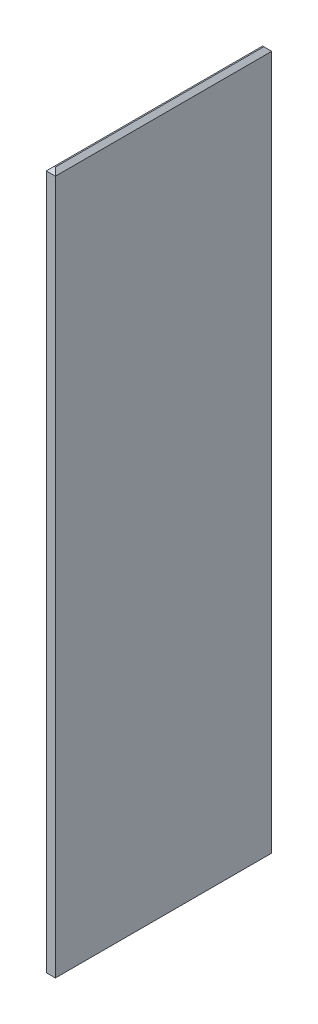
from build123d import *

# Parameters (mm, degrees)
SKETCH1_W           = 127
SKETCH1_H           = 3000
BOSS_EXTRUDE1_DEPTH = 9739.6
CHAMFER1_SIZE       = 55


with BuildPart() as part:
    # Sketch1 → Boss-Extrude1 (new body)
    with BuildSketch(Plane(origin=(0, 0, 0), x_dir=(-1, 0, 0), z_dir=(0, 1, 0))):
        Rectangle(SKETCH1_W, SKETCH1_H)
    extrude(amount=BOSS_EXTRUDE1_DEPTH)

    # Chamfer1
    chamfer1_edges = [part.edges().sort_by_distance(p)[0] for p in [
        (63.5, 9739.6, 0),
        (0, 9739.6, -1500),
        (-63.5, 9739.6, 0),
        (0, 0, -1500),
        (63.5, 0, 0),
        (0, 0, 1500),
        (-63.5, 0, 0),
        (0, 9739.6, 1500),
    ]]
    chamfer(chamfer1_edges, length=CHAMFER1_SIZE)


solid = part.part
